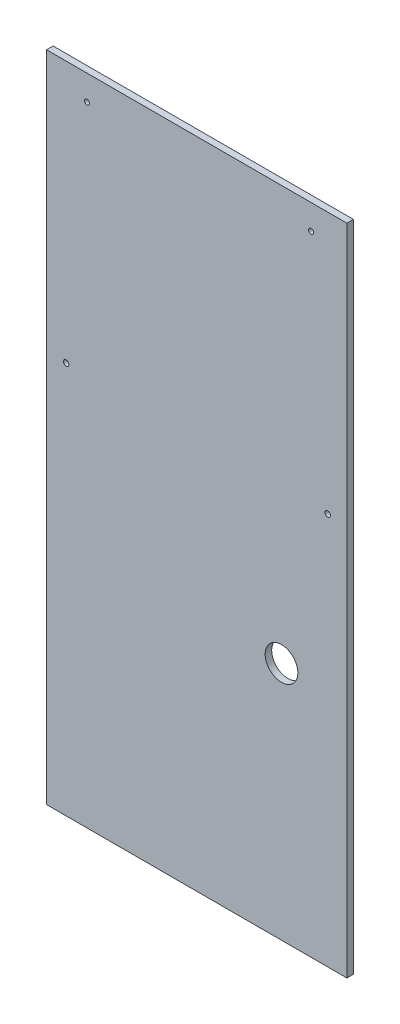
from build123d import *

# Parameters (mm, degrees)
SKETCH1_W           = 350.012
SKETCH1_H           = 762
BOSS_EXTRUDE1_DEPTH = 7.62
SKETCH2_R           = 2.921
CUT_EXTRUDE1_DEPTH  = 7.62
SKETCH3_R           = 19.05
CUT_EXTRUDE2_DEPTH  = 420.340153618
SKETCH6_R           = 3.175
CUT_EXTRUDE4_DEPTH  = 420.340153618


with BuildPart() as part:
    # Sketch1 → Boss-Extrude1 (new body)
    with BuildSketch(Plane.XY):
        Rectangle(SKETCH1_W, SKETCH1_H)
    extrude(amount=BOSS_EXTRUDE1_DEPTH)

    # Sketch2 → Cut-Extrude1 (cut)
    with BuildSketch(Plane.XY.offset(7.62)):
        with Locations((-128.016, 351.79)):
            Circle(SKETCH2_R)
        with Locations((133.35, 351.79)):
            Circle(SKETCH2_R)
    extrude(amount=-CUT_EXTRUDE1_DEPTH, mode=Mode.SUBTRACT)

    # Sketch3 → Cut-Extrude2 (cut, through all)
    with BuildSketch(Plane.XY.offset(7.62)):
        with Locations((98.806, -101.6)):
            Circle(SKETCH3_R)
    extrude(amount=-CUT_EXTRUDE2_DEPTH, mode=Mode.SUBTRACT)

    # Sketch6 → Cut-Extrude4 (cut, through all)
    with BuildSketch(Plane.XY.offset(7.62)):
        with Locations((152.608700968, 76.2)):
            Circle(SKETCH6_R)
        with Locations((-152.146, 76.2)):
            Circle(SKETCH6_R)
    extrude(amount=-CUT_EXTRUDE4_DEPTH, mode=Mode.SUBTRACT)


solid = part.part
